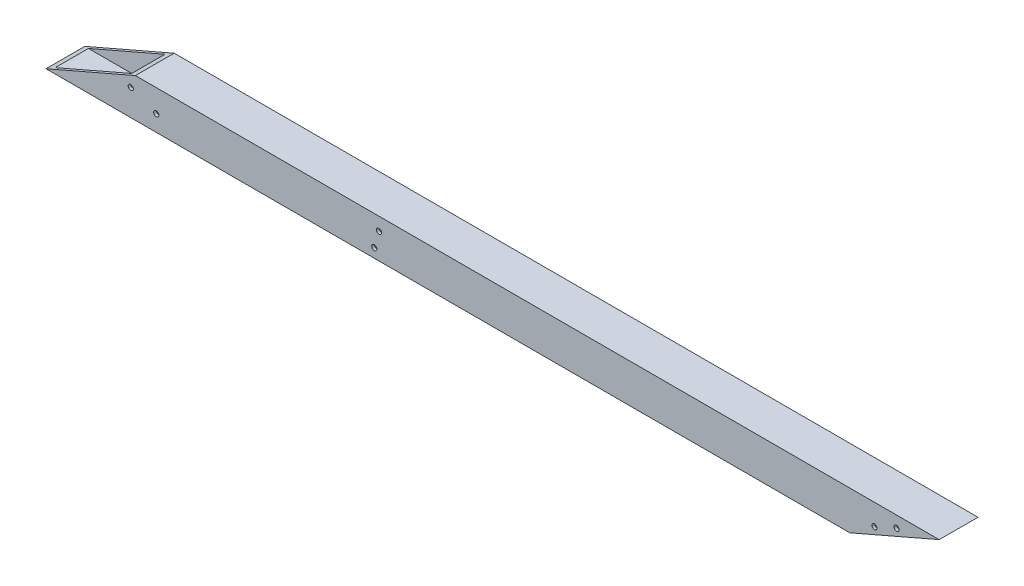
ISO-10303-21;
HEADER;
FILE_DESCRIPTION(('STEP AP214'),'2;1');
FILE_NAME('part.step','',(''),(''),'','','');
FILE_SCHEMA(('AUTOMOTIVE_DESIGN { 1 0 10303 214 1 1 1 1 }'));
ENDSEC;
DATA;
#1=APPLICATION_CONTEXT('core data for automotive mechanical design processes');
#2=APPLICATION_PROTOCOL_DEFINITION('international standard','automotive_design',2000,#1);
#3=PRODUCT_CONTEXT('',#1,'mechanical');
#4=PRODUCT('Part','Part','',(#3));
#5=PRODUCT_RELATED_PRODUCT_CATEGORY('part','',(#4));
#6=PRODUCT_DEFINITION_FORMATION('','',#4);
#7=PRODUCT_DEFINITION_CONTEXT('part definition',#1,'design');
#8=PRODUCT_DEFINITION('design','',#6,#7);
#9=PRODUCT_DEFINITION_SHAPE('','',#8);
#10=(LENGTH_UNIT() NAMED_UNIT(*) SI_UNIT(.MILLI.,.METRE.));
#11=(NAMED_UNIT(*) PLANE_ANGLE_UNIT() SI_UNIT($,.RADIAN.));
#12=(NAMED_UNIT(*) SI_UNIT($,.STERADIAN.) SOLID_ANGLE_UNIT());
#13=UNCERTAINTY_MEASURE_WITH_UNIT(LENGTH_MEASURE(1.E-05),#10,'distance_accuracy_value','');
#14=(GEOMETRIC_REPRESENTATION_CONTEXT(3) GLOBAL_UNCERTAINTY_ASSIGNED_CONTEXT((#13)) GLOBAL_UNIT_ASSIGNED_CONTEXT((#10,
#11,#12)) REPRESENTATION_CONTEXT('',''));
#15=CARTESIAN_POINT('',(0.,0.,0.));
#16=DIRECTION('',(0.,0.,1.));
#17=DIRECTION('',(1.,0.,0.));
#18=AXIS2_PLACEMENT_3D('',#15,#16,#17);
#19=CARTESIAN_POINT('',(3048.,0.,0.));
#20=DIRECTION('',(0.,0.,-1.));
#21=DIRECTION('',(-1.,0.,0.));
#22=AXIS2_PLACEMENT_3D('',#19,#20,#21);
#23=PLANE('',#22);
#24=CARTESIAN_POINT('',(1989.14315691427,34.3210482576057,0.));
#25=DIRECTION('',(0.,0.,-1.));
#26=DIRECTION('',(-1.,0.,0.));
#27=AXIS2_PLACEMENT_3D('',#24,#25,#26);
#28=CIRCLE('',#27,3.37312000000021);
#29=CARTESIAN_POINT('',(1985.77003691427,34.3210482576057,0.));
#30=VERTEX_POINT('',#29);
#31=EDGE_CURVE('E264',#30,#30,#28,.T.);
#32=ORIENTED_EDGE('',*,*,#31,.T.);
#33=EDGE_LOOP('',(#32));
#34=FACE_BOUND('',#33,.T.);
#35=CARTESIAN_POINT('',(2022.55519451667,21.1318199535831,0.));
#36=DIRECTION('',(0.,0.,-1.));
#37=DIRECTION('',(-1.,0.,0.));
#38=AXIS2_PLACEMENT_3D('',#35,#36,#37);
#39=CIRCLE('',#38,3.37312000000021);
#40=CARTESIAN_POINT('',(2019.18207451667,21.1318199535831,0.));
#41=VERTEX_POINT('',#40);
#42=EDGE_CURVE('E149',#41,#41,#39,.T.);
#43=ORIENTED_EDGE('',*,*,#42,.T.);
#44=EDGE_LOOP('',(#43));
#45=FACE_BOUND('',#44,.T.);
#46=CARTESIAN_POINT('',(2963.08326594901,23.0188741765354,0.));
#47=DIRECTION('',(0.,0.,1.));
#48=DIRECTION('',(1.,0.,0.));
#49=AXIS2_PLACEMENT_3D('',#46,#47,#48);
#50=CIRCLE('',#49,3.3731200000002);
#51=CARTESIAN_POINT('',(2966.45638594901,23.0188741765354,0.));
#52=VERTEX_POINT('',#51);
#53=EDGE_CURVE('E189',#52,#52,#50,.T.);
#54=ORIENTED_EDGE('',*,*,#53,.F.);
#55=EDGE_LOOP('',(#54));
#56=FACE_BOUND('',#55,.T.);
#57=CARTESIAN_POINT('',(2314.32734260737,33.6323173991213,0.));
#58=DIRECTION('',(0.,0.,1.));
#59=DIRECTION('',(1.,0.,0.));
#60=AXIS2_PLACEMENT_3D('',#57,#58,#59);
#61=CIRCLE('',#60,3.37312000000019);
#62=CARTESIAN_POINT('',(2317.70046260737,33.6323173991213,0.));
#63=VERTEX_POINT('',#62);
#64=EDGE_CURVE('E196',#63,#63,#61,.T.);
#65=ORIENTED_EDGE('',*,*,#64,.F.);
#66=EDGE_LOOP('',(#65));
#67=FACE_BOUND('',#66,.T.);
#68=CARTESIAN_POINT('',(2308.10725809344,12.0605349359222,0.));
#69=DIRECTION('',(0.,0.,1.));
#70=DIRECTION('',(1.,0.,0.));
#71=AXIS2_PLACEMENT_3D('',#68,#69,#70);
#72=CIRCLE('',#71,3.3731200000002);
#73=CARTESIAN_POINT('',(2311.48037809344,12.0605349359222,0.));
#74=VERTEX_POINT('',#73);
#75=EDGE_CURVE('E203',#74,#74,#72,.T.);
#76=ORIENTED_EDGE('',*,*,#75,.F.);
#77=EDGE_LOOP('',(#76));
#78=FACE_BOUND('',#77,.T.);
#79=CARTESIAN_POINT('',(2992.12254868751,35.8556400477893,0.));
#80=DIRECTION('',(0.,0.,1.));
#81=DIRECTION('',(1.,0.,0.));
#82=AXIS2_PLACEMENT_3D('',#79,#80,#81);
#83=CIRCLE('',#82,3.37312000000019);
#84=CARTESIAN_POINT('',(2995.49566868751,35.8556400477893,0.));
#85=VERTEX_POINT('',#84);
#86=EDGE_CURVE('E210',#85,#85,#83,.T.);
#87=ORIENTED_EDGE('',*,*,#86,.F.);
#88=EDGE_LOOP('',(#87));
#89=FACE_BOUND('',#88,.T.);
#90=DIRECTION('',(-1.,0.,0.));
#91=VECTOR('',#90,1.);
#92=CARTESIAN_POINT('',(3048.,0.,0.));
#93=LINE('',#92,#91);
#94=CARTESIAN_POINT('',(2930.93692171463,0.,0.));
#95=VERTEX_POINT('',#94);
#96=CARTESIAN_POINT('',(1878.151441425,0.,0.));
#97=VERTEX_POINT('',#96);
#98=EDGE_CURVE('E38',#95,#97,#93,.T.);
#99=ORIENTED_EDGE('',*,*,#98,.F.);
#100=DIRECTION('',(0.917347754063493,0.398086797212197,0.));
#101=VECTOR('',#100,1.);
#102=CARTESIAN_POINT('',(3048.,50.8,0.));
#103=LINE('',#102,#101);
#104=CARTESIAN_POINT('',(3048.,50.8,0.));
#105=VERTEX_POINT('',#104);
#106=EDGE_CURVE('E99',#95,#105,#103,.T.);
#107=ORIENTED_EDGE('',*,*,#106,.T.);
#108=DIRECTION('',(-1.,0.,0.));
#109=VECTOR('',#108,1.);
#110=CARTESIAN_POINT('',(3048.,50.8,0.));
#111=LINE('',#110,#109);
#112=CARTESIAN_POINT('',(1995.21451971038,50.8,0.));
#113=VERTEX_POINT('',#112);
#114=EDGE_CURVE('E107',#105,#113,#111,.T.);
#115=ORIENTED_EDGE('',*,*,#114,.T.);
#116=DIRECTION('',(-0.917347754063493,-0.398086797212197,0.));
#117=VECTOR('',#116,1.);
#118=CARTESIAN_POINT('',(1878.151441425,0.,0.));
#119=LINE('',#118,#117);
#120=EDGE_CURVE('E173',#113,#97,#119,.T.);
#121=ORIENTED_EDGE('',*,*,#120,.T.);
#122=EDGE_LOOP('',(#99,#107,#115,#121));
#123=FACE_BOUND('',#122,.T.);
#124=ADVANCED_FACE('F30',(#34,#45,#56,#67,#78,#89,#123),#23,.F.);
#125=CARTESIAN_POINT('',(3048.,0.,0.));
#126=DIRECTION('',(0.,1.,0.));
#127=DIRECTION('',(0.,0.,1.));
#128=AXIS2_PLACEMENT_3D('',#125,#126,#127);
#129=PLANE('',#128);
#130=DIRECTION('',(-1.,0.,0.));
#131=VECTOR('',#130,1.);
#132=CARTESIAN_POINT('',(3048.,0.,-50.8));
#133=LINE('',#132,#131);
#134=CARTESIAN_POINT('',(2930.93692171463,0.,-50.8));
#135=VERTEX_POINT('',#134);
#136=CARTESIAN_POINT('',(1878.151441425,0.,-50.8));
#137=VERTEX_POINT('',#136);
#138=EDGE_CURVE('E121',#135,#137,#133,.T.);
#139=ORIENTED_EDGE('',*,*,#138,.F.);
#140=DIRECTION('',(0.,0.,1.));
#141=VECTOR('',#140,1.);
#142=CARTESIAN_POINT('',(2930.93692171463,0.,0.));
#143=LINE('',#142,#141);
#144=EDGE_CURVE('E170',#135,#95,#143,.T.);
#145=ORIENTED_EDGE('',*,*,#144,.T.);
#146=ORIENTED_EDGE('',*,*,#98,.T.);
#147=DIRECTION('',(0.,0.,-1.));
#148=VECTOR('',#147,1.);
#149=CARTESIAN_POINT('',(1878.151441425,0.,0.));
#150=LINE('',#149,#148);
#151=EDGE_CURVE('E217',#97,#137,#150,.T.);
#152=ORIENTED_EDGE('',*,*,#151,.T.);
#153=EDGE_LOOP('',(#139,#145,#146,#152));
#154=FACE_BOUND('',#153,.T.);
#155=ADVANCED_FACE('F255',(#154),#129,.F.);
#156=CARTESIAN_POINT('',(3048.,0.,-50.8));
#157=DIRECTION('',(0.,0.,1.));
#158=DIRECTION('',(1.,0.,0.));
#159=AXIS2_PLACEMENT_3D('',#156,#157,#158);
#160=PLANE('',#159);
#161=CARTESIAN_POINT('',(1989.14315691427,34.3210482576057,-50.8));
#162=DIRECTION('',(0.,0.,-1.));
#163=DIRECTION('',(-1.,0.,0.));
#164=AXIS2_PLACEMENT_3D('',#161,#162,#163);
#165=CIRCLE('',#164,3.37312000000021);
#166=CARTESIAN_POINT('',(1985.77003691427,34.3210482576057,-50.8));
#167=VERTEX_POINT('',#166);
#168=EDGE_CURVE('E309',#167,#167,#165,.T.);
#169=ORIENTED_EDGE('',*,*,#168,.F.);
#170=EDGE_LOOP('',(#169));
#171=FACE_BOUND('',#170,.T.);
#172=CARTESIAN_POINT('',(2022.55519451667,21.1318199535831,-50.8));
#173=DIRECTION('',(0.,0.,-1.));
#174=DIRECTION('',(-1.,0.,0.));
#175=AXIS2_PLACEMENT_3D('',#172,#173,#174);
#176=CIRCLE('',#175,3.37312000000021);
#177=CARTESIAN_POINT('',(2019.18207451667,21.1318199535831,-50.8));
#178=VERTEX_POINT('',#177);
#179=EDGE_CURVE('E155',#178,#178,#176,.T.);
#180=ORIENTED_EDGE('',*,*,#179,.F.);
#181=EDGE_LOOP('',(#180));
#182=FACE_BOUND('',#181,.T.);
#183=CARTESIAN_POINT('',(2963.08326594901,23.0188741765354,-50.8));
#184=DIRECTION('',(0.,0.,1.));
#185=DIRECTION('',(1.,0.,0.));
#186=AXIS2_PLACEMENT_3D('',#183,#184,#185);
#187=CIRCLE('',#186,3.3731200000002);
#188=CARTESIAN_POINT('',(2966.45638594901,23.0188741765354,-50.8));
#189=VERTEX_POINT('',#188);
#190=EDGE_CURVE('E145',#189,#189,#187,.T.);
#191=ORIENTED_EDGE('',*,*,#190,.T.);
#192=EDGE_LOOP('',(#191));
#193=FACE_BOUND('',#192,.T.);
#194=CARTESIAN_POINT('',(2314.32734260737,33.6323173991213,-50.8));
#195=DIRECTION('',(0.,0.,1.));
#196=DIRECTION('',(1.,0.,0.));
#197=AXIS2_PLACEMENT_3D('',#194,#195,#196);
#198=CIRCLE('',#197,3.37312000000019);
#199=CARTESIAN_POINT('',(2317.70046260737,33.6323173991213,-50.8));
#200=VERTEX_POINT('',#199);
#201=EDGE_CURVE('E141',#200,#200,#198,.T.);
#202=ORIENTED_EDGE('',*,*,#201,.T.);
#203=EDGE_LOOP('',(#202));
#204=FACE_BOUND('',#203,.T.);
#205=CARTESIAN_POINT('',(2308.10725809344,12.0605349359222,-50.8));
#206=DIRECTION('',(0.,0.,1.));
#207=DIRECTION('',(1.,0.,0.));
#208=AXIS2_PLACEMENT_3D('',#205,#206,#207);
#209=CIRCLE('',#208,3.3731200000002);
#210=CARTESIAN_POINT('',(2311.48037809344,12.0605349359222,-50.8));
#211=VERTEX_POINT('',#210);
#212=EDGE_CURVE('E136',#211,#211,#209,.T.);
#213=ORIENTED_EDGE('',*,*,#212,.T.);
#214=EDGE_LOOP('',(#213));
#215=FACE_BOUND('',#214,.T.);
#216=CARTESIAN_POINT('',(2992.12254868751,35.8556400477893,-50.8));
#217=DIRECTION('',(0.,0.,1.));
#218=DIRECTION('',(1.,0.,0.));
#219=AXIS2_PLACEMENT_3D('',#216,#217,#218);
#220=CIRCLE('',#219,3.37312000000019);
#221=CARTESIAN_POINT('',(2995.49566868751,35.8556400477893,-50.8));
#222=VERTEX_POINT('',#221);
#223=EDGE_CURVE('E131',#222,#222,#220,.T.);
#224=ORIENTED_EDGE('',*,*,#223,.T.);
#225=EDGE_LOOP('',(#224));
#226=FACE_BOUND('',#225,.T.);
#227=DIRECTION('',(-1.,0.,0.));
#228=VECTOR('',#227,1.);
#229=CARTESIAN_POINT('',(3048.,50.8,-50.8));
#230=LINE('',#229,#228);
#231=CARTESIAN_POINT('',(3048.,50.8,-50.8));
#232=VERTEX_POINT('',#231);
#233=CARTESIAN_POINT('',(1995.21451971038,50.8,-50.8));
#234=VERTEX_POINT('',#233);
#235=EDGE_CURVE('E119',#232,#234,#230,.T.);
#236=ORIENTED_EDGE('',*,*,#235,.F.);
#237=DIRECTION('',(0.917347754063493,0.398086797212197,0.));
#238=VECTOR('',#237,1.);
#239=CARTESIAN_POINT('',(3048.,50.8,-50.8));
#240=LINE('',#239,#238);
#241=EDGE_CURVE('E102',#135,#232,#240,.T.);
#242=ORIENTED_EDGE('',*,*,#241,.F.);
#243=ORIENTED_EDGE('',*,*,#138,.T.);
#244=DIRECTION('',(-0.917347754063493,-0.398086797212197,0.));
#245=VECTOR('',#244,1.);
#246=CARTESIAN_POINT('',(1878.151441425,0.,-50.8));
#247=LINE('',#246,#245);
#248=EDGE_CURVE('E172',#234,#137,#247,.T.);
#249=ORIENTED_EDGE('',*,*,#248,.F.);
#250=EDGE_LOOP('',(#236,#242,#243,#249));
#251=FACE_BOUND('',#250,.T.);
#252=ADVANCED_FACE('F260',(#171,#182,#193,#204,#215,#226,#251),#160,.F.);
#253=CARTESIAN_POINT('',(3048.,50.8,0.));
#254=DIRECTION('',(0.,-1.,0.));
#255=DIRECTION('',(0.,0.,-1.));
#256=AXIS2_PLACEMENT_3D('',#253,#254,#255);
#257=PLANE('',#256);
#258=ORIENTED_EDGE('',*,*,#235,.T.);
#259=DIRECTION('',(0.,0.,1.));
#260=VECTOR('',#259,1.);
#261=CARTESIAN_POINT('',(1995.21451971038,50.8,0.));
#262=LINE('',#261,#260);
#263=EDGE_CURVE('E118',#234,#113,#262,.T.);
#264=ORIENTED_EDGE('',*,*,#263,.T.);
#265=ORIENTED_EDGE('',*,*,#114,.F.);
#266=DIRECTION('',(0.,0.,1.));
#267=VECTOR('',#266,1.);
#268=CARTESIAN_POINT('',(3048.,50.8,0.));
#269=LINE('',#268,#267);
#270=EDGE_CURVE('E96',#232,#105,#269,.T.);
#271=ORIENTED_EDGE('',*,*,#270,.F.);
#272=EDGE_LOOP('',(#258,#264,#265,#271));
#273=FACE_BOUND('',#272,.T.);
#274=ADVANCED_FACE('F117',(#273),#257,.F.);
#275=CARTESIAN_POINT('',(3048.,47.1424,-3.6576));
#276=DIRECTION('',(0.,0.,-1.));
#277=DIRECTION('',(0.,1.,0.));
#278=AXIS2_PLACEMENT_3D('',#275,#276,#277);
#279=PLANE('',#278);
#280=CARTESIAN_POINT('',(1989.14315691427,34.3210482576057,-3.6576));
#281=DIRECTION('',(0.,0.,-1.));
#282=DIRECTION('',(0.,1.,0.));
#283=AXIS2_PLACEMENT_3D('',#280,#281,#282);
#284=CIRCLE('',#283,3.37312000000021);
#285=CARTESIAN_POINT('',(1989.14315691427,37.6941682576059,-3.6576));
#286=VERTEX_POINT('',#285);
#287=EDGE_CURVE('E160',#286,#286,#284,.T.);
#288=ORIENTED_EDGE('',*,*,#287,.F.);
#289=EDGE_LOOP('',(#288));
#290=FACE_BOUND('',#289,.T.);
#291=CARTESIAN_POINT('',(2022.55519451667,21.1318199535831,-3.6576));
#292=DIRECTION('',(0.,0.,-1.));
#293=DIRECTION('',(0.,1.,0.));
#294=AXIS2_PLACEMENT_3D('',#291,#292,#293);
#295=CIRCLE('',#294,3.37312000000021);
#296=CARTESIAN_POINT('',(2022.55519451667,24.5049399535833,-3.6576));
#297=VERTEX_POINT('',#296);
#298=EDGE_CURVE('E148',#297,#297,#295,.T.);
#299=ORIENTED_EDGE('',*,*,#298,.F.);
#300=EDGE_LOOP('',(#299));
#301=FACE_BOUND('',#300,.T.);
#302=DIRECTION('',(0.917347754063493,0.398086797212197,0.));
#303=VECTOR('',#302,1.);
#304=CARTESIAN_POINT('',(3046.66430289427,50.2203687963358,-3.6576));
#305=LINE('',#304,#303);
#306=CARTESIAN_POINT('',(2939.36546335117,3.6576,-3.6576));
#307=VERTEX_POINT('',#306);
#308=CARTESIAN_POINT('',(3039.57145836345,47.1424,-3.6576));
#309=VERTEX_POINT('',#308);
#310=EDGE_CURVE('E45',#307,#309,#305,.T.);
#311=ORIENTED_EDGE('',*,*,#310,.F.);
#312=DIRECTION('',(-1.,0.,0.));
#313=VECTOR('',#312,1.);
#314=CARTESIAN_POINT('',(3048.,3.6576,-3.6576));
#315=LINE('',#314,#313);
#316=CARTESIAN_POINT('',(1886.57998306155,3.6576,-3.6576));
#317=VERTEX_POINT('',#316);
#318=EDGE_CURVE('E108',#307,#317,#315,.T.);
#319=ORIENTED_EDGE('',*,*,#318,.T.);
#320=DIRECTION('',(-0.917347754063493,-0.398086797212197,0.));
#321=VECTOR('',#320,1.);
#322=CARTESIAN_POINT('',(2879.82612618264,434.680812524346,-3.65759999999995));
#323=LINE('',#322,#321);
#324=CARTESIAN_POINT('',(1986.78597807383,47.1424,-3.6576));
#325=VERTEX_POINT('',#324);
#326=EDGE_CURVE('E185',#325,#317,#323,.T.);
#327=ORIENTED_EDGE('',*,*,#326,.F.);
#328=DIRECTION('',(-1.,0.,0.));
#329=VECTOR('',#328,1.);
#330=CARTESIAN_POINT('',(3048.,47.1424,-3.6576));
#331=LINE('',#330,#329);
#332=EDGE_CURVE('E220',#309,#325,#331,.T.);
#333=ORIENTED_EDGE('',*,*,#332,.F.);
#334=EDGE_LOOP('',(#311,#319,#327,#333));
#335=FACE_BOUND('',#334,.T.);
#336=CARTESIAN_POINT('',(2963.08326594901,23.0188741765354,-3.6576));
#337=DIRECTION('',(0.,0.,-1.));
#338=DIRECTION('',(0.,1.,0.));
#339=AXIS2_PLACEMENT_3D('',#336,#337,#338);
#340=CIRCLE('',#339,3.3731200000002);
#341=CARTESIAN_POINT('',(2963.08326594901,26.3919941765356,-3.6576));
#342=VERTEX_POINT('',#341);
#343=EDGE_CURVE('E144',#342,#342,#340,.T.);
#344=ORIENTED_EDGE('',*,*,#343,.F.);
#345=EDGE_LOOP('',(#344));
#346=FACE_BOUND('',#345,.T.);
#347=CARTESIAN_POINT('',(2314.32734260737,33.6323173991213,-3.6576));
#348=DIRECTION('',(0.,0.,-1.));
#349=DIRECTION('',(0.,1.,0.));
#350=AXIS2_PLACEMENT_3D('',#347,#348,#349);
#351=CIRCLE('',#350,3.37312000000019);
#352=CARTESIAN_POINT('',(2314.32734260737,37.0054373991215,-3.6576));
#353=VERTEX_POINT('',#352);
#354=EDGE_CURVE('E140',#353,#353,#351,.T.);
#355=ORIENTED_EDGE('',*,*,#354,.F.);
#356=EDGE_LOOP('',(#355));
#357=FACE_BOUND('',#356,.T.);
#358=CARTESIAN_POINT('',(2308.10725809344,12.0605349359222,-3.6576));
#359=DIRECTION('',(0.,0.,-1.));
#360=DIRECTION('',(0.,1.,0.));
#361=AXIS2_PLACEMENT_3D('',#358,#359,#360);
#362=CIRCLE('',#361,3.3731200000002);
#363=CARTESIAN_POINT('',(2308.10725809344,15.4336549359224,-3.6576));
#364=VERTEX_POINT('',#363);
#365=EDGE_CURVE('E135',#364,#364,#362,.T.);
#366=ORIENTED_EDGE('',*,*,#365,.F.);
#367=EDGE_LOOP('',(#366));
#368=FACE_BOUND('',#367,.T.);
#369=CARTESIAN_POINT('',(2992.12254868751,35.8556400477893,-3.6576));
#370=DIRECTION('',(0.,0.,-1.));
#371=DIRECTION('',(0.,1.,0.));
#372=AXIS2_PLACEMENT_3D('',#369,#370,#371);
#373=CIRCLE('',#372,3.37312000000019);
#374=CARTESIAN_POINT('',(2992.12254868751,39.2287600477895,-3.6576));
#375=VERTEX_POINT('',#374);
#376=EDGE_CURVE('E130',#375,#375,#373,.T.);
#377=ORIENTED_EDGE('',*,*,#376,.F.);
#378=EDGE_LOOP('',(#377));
#379=FACE_BOUND('',#378,.T.);
#380=ADVANCED_FACE('F227',(#290,#301,#335,#346,#357,#368,#379),#279,.T.);
#381=CARTESIAN_POINT('',(3048.,3.6576,-3.6576));
#382=DIRECTION('',(0.,1.,0.));
#383=DIRECTION('',(0.,0.,1.));
#384=AXIS2_PLACEMENT_3D('',#381,#382,#383);
#385=PLANE('',#384);
#386=DIRECTION('',(0.,0.,1.));
#387=VECTOR('',#386,1.);
#388=CARTESIAN_POINT('',(2939.36546335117,3.6576,-3.6576));
#389=LINE('',#388,#387);
#390=CARTESIAN_POINT('',(2939.36546335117,3.6576,-47.1424));
#391=VERTEX_POINT('',#390);
#392=EDGE_CURVE('E167',#391,#307,#389,.T.);
#393=ORIENTED_EDGE('',*,*,#392,.F.);
#394=DIRECTION('',(-1.,0.,0.));
#395=VECTOR('',#394,1.);
#396=CARTESIAN_POINT('',(3048.,3.6576,-47.1424));
#397=LINE('',#396,#395);
#398=CARTESIAN_POINT('',(1886.57998306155,3.65760000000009,-47.1424));
#399=VERTEX_POINT('',#398);
#400=EDGE_CURVE('E223',#391,#399,#397,.T.);
#401=ORIENTED_EDGE('',*,*,#400,.T.);
#402=DIRECTION('',(0.,0.,-1.));
#403=VECTOR('',#402,1.);
#404=CARTESIAN_POINT('',(1886.57998306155,3.6576,-3.6576));
#405=LINE('',#404,#403);
#406=EDGE_CURVE('E182',#317,#399,#405,.T.);
#407=ORIENTED_EDGE('',*,*,#406,.F.);
#408=ORIENTED_EDGE('',*,*,#318,.F.);
#409=EDGE_LOOP('',(#393,#401,#407,#408));
#410=FACE_BOUND('',#409,.T.);
#411=ADVANCED_FACE('F237',(#410),#385,.T.);
#412=CARTESIAN_POINT('',(3048.,47.1424,-47.1424));
#413=DIRECTION('',(0.,0.,1.));
#414=DIRECTION('',(0.,-1.,0.));
#415=AXIS2_PLACEMENT_3D('',#412,#413,#414);
#416=PLANE('',#415);
#417=CARTESIAN_POINT('',(1989.14315691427,34.3210482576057,-47.1424));
#418=DIRECTION('',(0.,0.,1.));
#419=DIRECTION('',(0.,-1.,0.));
#420=AXIS2_PLACEMENT_3D('',#417,#418,#419);
#421=CIRCLE('',#420,3.37312000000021);
#422=CARTESIAN_POINT('',(1989.14315691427,30.9479282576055,-47.1424));
#423=VERTEX_POINT('',#422);
#424=EDGE_CURVE('E33',#423,#423,#421,.T.);
#425=ORIENTED_EDGE('',*,*,#424,.F.);
#426=EDGE_LOOP('',(#425));
#427=FACE_BOUND('',#426,.T.);
#428=CARTESIAN_POINT('',(2022.55519451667,21.1318199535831,-47.1424));
#429=DIRECTION('',(0.,0.,1.));
#430=DIRECTION('',(0.,-1.,0.));
#431=AXIS2_PLACEMENT_3D('',#428,#429,#430);
#432=CIRCLE('',#431,3.37312000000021);
#433=CARTESIAN_POINT('',(2022.55519451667,17.7586999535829,-47.1424));
#434=VERTEX_POINT('',#433);
#435=EDGE_CURVE('E146',#434,#434,#432,.T.);
#436=ORIENTED_EDGE('',*,*,#435,.F.);
#437=EDGE_LOOP('',(#436));
#438=FACE_BOUND('',#437,.T.);
#439=DIRECTION('',(-0.917347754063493,-0.398086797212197,0.));
#440=VECTOR('',#439,1.);
#441=CARTESIAN_POINT('',(3046.66430289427,50.2203687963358,-47.1424));
#442=LINE('',#441,#440);
#443=CARTESIAN_POINT('',(3039.57145836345,47.1424,-47.1424));
#444=VERTEX_POINT('',#443);
#445=EDGE_CURVE('E114',#444,#391,#442,.T.);
#446=ORIENTED_EDGE('',*,*,#445,.F.);
#447=DIRECTION('',(-1.,0.,0.));
#448=VECTOR('',#447,1.);
#449=CARTESIAN_POINT('',(3048.,47.1424,-47.1424));
#450=LINE('',#449,#448);
#451=CARTESIAN_POINT('',(1986.78597807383,47.1424,-47.1424));
#452=VERTEX_POINT('',#451);
#453=EDGE_CURVE('E53',#444,#452,#450,.T.);
#454=ORIENTED_EDGE('',*,*,#453,.T.);
#455=DIRECTION('',(0.917347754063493,0.398086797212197,0.));
#456=VECTOR('',#455,1.);
#457=CARTESIAN_POINT('',(2879.82612618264,434.680812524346,-47.1423999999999));
#458=LINE('',#457,#456);
#459=EDGE_CURVE('E180',#399,#452,#458,.T.);
#460=ORIENTED_EDGE('',*,*,#459,.F.);
#461=ORIENTED_EDGE('',*,*,#400,.F.);
#462=EDGE_LOOP('',(#446,#454,#460,#461));
#463=FACE_BOUND('',#462,.T.);
#464=CARTESIAN_POINT('',(2963.08326594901,23.0188741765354,-47.1424));
#465=DIRECTION('',(0.,0.,1.));
#466=DIRECTION('',(0.,-1.,0.));
#467=AXIS2_PLACEMENT_3D('',#464,#465,#466);
#468=CIRCLE('',#467,3.3731200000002);
#469=CARTESIAN_POINT('',(2963.08326594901,19.6457541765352,-47.1424));
#470=VERTEX_POINT('',#469);
#471=EDGE_CURVE('E142',#470,#470,#468,.T.);
#472=ORIENTED_EDGE('',*,*,#471,.F.);
#473=EDGE_LOOP('',(#472));
#474=FACE_BOUND('',#473,.T.);
#475=CARTESIAN_POINT('',(2314.32734260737,33.6323173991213,-47.1424));
#476=DIRECTION('',(0.,0.,1.));
#477=DIRECTION('',(0.,-1.,0.));
#478=AXIS2_PLACEMENT_3D('',#475,#476,#477);
#479=CIRCLE('',#478,3.37312000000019);
#480=CARTESIAN_POINT('',(2314.32734260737,30.2591973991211,-47.1424));
#481=VERTEX_POINT('',#480);
#482=EDGE_CURVE('E137',#481,#481,#479,.T.);
#483=ORIENTED_EDGE('',*,*,#482,.F.);
#484=EDGE_LOOP('',(#483));
#485=FACE_BOUND('',#484,.T.);
#486=CARTESIAN_POINT('',(2308.10725809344,12.0605349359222,-47.1424));
#487=DIRECTION('',(0.,0.,1.));
#488=DIRECTION('',(0.,-1.,0.));
#489=AXIS2_PLACEMENT_3D('',#486,#487,#488);
#490=CIRCLE('',#489,3.3731200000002);
#491=CARTESIAN_POINT('',(2308.10725809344,8.68741493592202,-47.1424));
#492=VERTEX_POINT('',#491);
#493=EDGE_CURVE('E132',#492,#492,#490,.T.);
#494=ORIENTED_EDGE('',*,*,#493,.F.);
#495=EDGE_LOOP('',(#494));
#496=FACE_BOUND('',#495,.T.);
#497=CARTESIAN_POINT('',(2992.12254868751,35.8556400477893,-47.1424));
#498=DIRECTION('',(0.,0.,1.));
#499=DIRECTION('',(0.,-1.,0.));
#500=AXIS2_PLACEMENT_3D('',#497,#498,#499);
#501=CIRCLE('',#500,3.37312000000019);
#502=CARTESIAN_POINT('',(2992.12254868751,32.4825200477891,-47.1424));
#503=VERTEX_POINT('',#502);
#504=EDGE_CURVE('E127',#503,#503,#501,.T.);
#505=ORIENTED_EDGE('',*,*,#504,.F.);
#506=EDGE_LOOP('',(#505));
#507=FACE_BOUND('',#506,.T.);
#508=ADVANCED_FACE('F239',(#427,#438,#463,#474,#485,#496,#507),#416,.T.);
#509=CARTESIAN_POINT('',(3048.,47.1424,-3.6576));
#510=DIRECTION('',(0.,-1.,0.));
#511=DIRECTION('',(0.,0.,-1.));
#512=AXIS2_PLACEMENT_3D('',#509,#510,#511);
#513=PLANE('',#512);
#514=DIRECTION('',(0.,0.,-1.));
#515=VECTOR('',#514,1.);
#516=CARTESIAN_POINT('',(3039.57145836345,47.1424,-3.6576));
#517=LINE('',#516,#515);
#518=EDGE_CURVE('E11',#309,#444,#517,.T.);
#519=ORIENTED_EDGE('',*,*,#518,.F.);
#520=ORIENTED_EDGE('',*,*,#332,.T.);
#521=DIRECTION('',(0.,0.,1.));
#522=VECTOR('',#521,1.);
#523=CARTESIAN_POINT('',(1986.78597807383,47.1424,-3.6576));
#524=LINE('',#523,#522);
#525=EDGE_CURVE('E175',#452,#325,#524,.T.);
#526=ORIENTED_EDGE('',*,*,#525,.F.);
#527=ORIENTED_EDGE('',*,*,#453,.F.);
#528=EDGE_LOOP('',(#519,#520,#526,#527));
#529=FACE_BOUND('',#528,.T.);
#530=ADVANCED_FACE('F242',(#529),#513,.T.);
#531=CARTESIAN_POINT('',(2992.12254868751,35.8556400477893,-50.8));
#532=DIRECTION('',(0.,0.,1.));
#533=DIRECTION('',(1.,0.,0.));
#534=AXIS2_PLACEMENT_3D('',#531,#532,#533);
#535=CYLINDRICAL_SURFACE('',#534,3.37312000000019);
#536=ORIENTED_EDGE('',*,*,#504,.T.);
#537=EDGE_LOOP('',(#536));
#538=FACE_BOUND('',#537,.T.);
#539=ORIENTED_EDGE('',*,*,#223,.F.);
#540=EDGE_LOOP('',(#539));
#541=FACE_BOUND('',#540,.T.);
#542=ADVANCED_FACE('F277',(#538,#541),#535,.F.);
#543=ORIENTED_EDGE('',*,*,#376,.T.);
#544=EDGE_LOOP('',(#543));
#545=FACE_BOUND('',#544,.T.);
#546=ORIENTED_EDGE('',*,*,#86,.T.);
#547=EDGE_LOOP('',(#546));
#548=FACE_BOUND('',#547,.T.);
#549=ADVANCED_FACE('F274',(#545,#548),#535,.F.);
#550=CARTESIAN_POINT('',(2308.10725809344,12.0605349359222,-50.8));
#551=DIRECTION('',(0.,0.,1.));
#552=DIRECTION('',(1.,0.,0.));
#553=AXIS2_PLACEMENT_3D('',#550,#551,#552);
#554=CYLINDRICAL_SURFACE('',#553,3.3731200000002);
#555=ORIENTED_EDGE('',*,*,#493,.T.);
#556=EDGE_LOOP('',(#555));
#557=FACE_BOUND('',#556,.T.);
#558=ORIENTED_EDGE('',*,*,#212,.F.);
#559=EDGE_LOOP('',(#558));
#560=FACE_BOUND('',#559,.T.);
#561=ADVANCED_FACE('F276',(#557,#560),#554,.F.);
#562=ORIENTED_EDGE('',*,*,#365,.T.);
#563=EDGE_LOOP('',(#562));
#564=FACE_BOUND('',#563,.T.);
#565=ORIENTED_EDGE('',*,*,#75,.T.);
#566=EDGE_LOOP('',(#565));
#567=FACE_BOUND('',#566,.T.);
#568=ADVANCED_FACE('F284',(#564,#567),#554,.F.);
#569=CARTESIAN_POINT('',(2314.32734260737,33.6323173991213,-50.8));
#570=DIRECTION('',(0.,0.,1.));
#571=DIRECTION('',(1.,0.,0.));
#572=AXIS2_PLACEMENT_3D('',#569,#570,#571);
#573=CYLINDRICAL_SURFACE('',#572,3.37312000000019);
#574=ORIENTED_EDGE('',*,*,#482,.T.);
#575=EDGE_LOOP('',(#574));
#576=FACE_BOUND('',#575,.T.);
#577=ORIENTED_EDGE('',*,*,#201,.F.);
#578=EDGE_LOOP('',(#577));
#579=FACE_BOUND('',#578,.T.);
#580=ADVANCED_FACE('F326',(#576,#579),#573,.F.);
#581=ORIENTED_EDGE('',*,*,#354,.T.);
#582=EDGE_LOOP('',(#581));
#583=FACE_BOUND('',#582,.T.);
#584=ORIENTED_EDGE('',*,*,#64,.T.);
#585=EDGE_LOOP('',(#584));
#586=FACE_BOUND('',#585,.T.);
#587=ADVANCED_FACE('F328',(#583,#586),#573,.F.);
#588=CARTESIAN_POINT('',(2963.08326594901,23.0188741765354,-50.8));
#589=DIRECTION('',(0.,0.,1.));
#590=DIRECTION('',(1.,0.,0.));
#591=AXIS2_PLACEMENT_3D('',#588,#589,#590);
#592=CYLINDRICAL_SURFACE('',#591,3.3731200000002);
#593=ORIENTED_EDGE('',*,*,#471,.T.);
#594=EDGE_LOOP('',(#593));
#595=FACE_BOUND('',#594,.T.);
#596=ORIENTED_EDGE('',*,*,#190,.F.);
#597=EDGE_LOOP('',(#596));
#598=FACE_BOUND('',#597,.T.);
#599=ADVANCED_FACE('F334',(#595,#598),#592,.F.);
#600=ORIENTED_EDGE('',*,*,#343,.T.);
#601=EDGE_LOOP('',(#600));
#602=FACE_BOUND('',#601,.T.);
#603=ORIENTED_EDGE('',*,*,#53,.T.);
#604=EDGE_LOOP('',(#603));
#605=FACE_BOUND('',#604,.T.);
#606=ADVANCED_FACE('F252',(#602,#605),#592,.F.);
#607=CARTESIAN_POINT('',(1878.151441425,0.,0.));
#608=DIRECTION('',(0.398086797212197,-0.917347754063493,0.));
#609=DIRECTION('',(0.917347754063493,0.398086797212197,0.));
#610=AXIS2_PLACEMENT_3D('',#607,#608,#609);
#611=PLANE('',#610);
#612=ORIENTED_EDGE('',*,*,#326,.T.);
#613=ORIENTED_EDGE('',*,*,#406,.T.);
#614=ORIENTED_EDGE('',*,*,#459,.T.);
#615=ORIENTED_EDGE('',*,*,#525,.T.);
#616=EDGE_LOOP('',(#612,#613,#614,#615));
#617=FACE_BOUND('',#616,.T.);
#618=ORIENTED_EDGE('',*,*,#248,.T.);
#619=ORIENTED_EDGE('',*,*,#151,.F.);
#620=ORIENTED_EDGE('',*,*,#120,.F.);
#621=ORIENTED_EDGE('',*,*,#263,.F.);
#622=EDGE_LOOP('',(#618,#619,#620,#621));
#623=FACE_BOUND('',#622,.T.);
#624=ADVANCED_FACE('F234',(#617,#623),#611,.F.);
#625=CARTESIAN_POINT('',(3048.,50.8,0.));
#626=DIRECTION('',(-0.398086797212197,0.917347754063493,0.));
#627=DIRECTION('',(-0.917347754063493,-0.398086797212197,0.));
#628=AXIS2_PLACEMENT_3D('',#625,#626,#627);
#629=PLANE('',#628);
#630=ORIENTED_EDGE('',*,*,#310,.T.);
#631=ORIENTED_EDGE('',*,*,#518,.T.);
#632=ORIENTED_EDGE('',*,*,#445,.T.);
#633=ORIENTED_EDGE('',*,*,#392,.T.);
#634=EDGE_LOOP('',(#630,#631,#632,#633));
#635=FACE_BOUND('',#634,.T.);
#636=ORIENTED_EDGE('',*,*,#241,.T.);
#637=ORIENTED_EDGE('',*,*,#270,.T.);
#638=ORIENTED_EDGE('',*,*,#106,.F.);
#639=ORIENTED_EDGE('',*,*,#144,.F.);
#640=EDGE_LOOP('',(#636,#637,#638,#639));
#641=FACE_BOUND('',#640,.T.);
#642=ADVANCED_FACE('F98',(#635,#641),#629,.F.);
#643=CARTESIAN_POINT('',(2022.55519451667,21.1318199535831,0.));
#644=DIRECTION('',(0.,0.,-1.));
#645=DIRECTION('',(-1.,0.,0.));
#646=AXIS2_PLACEMENT_3D('',#643,#644,#645);
#647=CYLINDRICAL_SURFACE('',#646,3.37312000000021);
#648=ORIENTED_EDGE('',*,*,#435,.T.);
#649=EDGE_LOOP('',(#648));
#650=FACE_BOUND('',#649,.T.);
#651=ORIENTED_EDGE('',*,*,#179,.T.);
#652=EDGE_LOOP('',(#651));
#653=FACE_BOUND('',#652,.T.);
#654=ADVANCED_FACE('F244',(#650,#653),#647,.F.);
#655=ORIENTED_EDGE('',*,*,#298,.T.);
#656=EDGE_LOOP('',(#655));
#657=FACE_BOUND('',#656,.T.);
#658=ORIENTED_EDGE('',*,*,#42,.F.);
#659=EDGE_LOOP('',(#658));
#660=FACE_BOUND('',#659,.T.);
#661=ADVANCED_FACE('F250',(#657,#660),#647,.F.);
#662=CARTESIAN_POINT('',(1989.14315691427,34.3210482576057,0.));
#663=DIRECTION('',(0.,0.,-1.));
#664=DIRECTION('',(-1.,0.,0.));
#665=AXIS2_PLACEMENT_3D('',#662,#663,#664);
#666=CYLINDRICAL_SURFACE('',#665,3.37312000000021);
#667=ORIENTED_EDGE('',*,*,#424,.T.);
#668=EDGE_LOOP('',(#667));
#669=FACE_BOUND('',#668,.T.);
#670=ORIENTED_EDGE('',*,*,#168,.T.);
#671=EDGE_LOOP('',(#670));
#672=FACE_BOUND('',#671,.T.);
#673=ADVANCED_FACE('F415',(#669,#672),#666,.F.);
#674=ORIENTED_EDGE('',*,*,#287,.T.);
#675=EDGE_LOOP('',(#674));
#676=FACE_BOUND('',#675,.T.);
#677=ORIENTED_EDGE('',*,*,#31,.F.);
#678=EDGE_LOOP('',(#677));
#679=FACE_BOUND('',#678,.T.);
#680=ADVANCED_FACE('F424',(#676,#679),#666,.F.);
#681=CLOSED_SHELL('',(#124,#155,#252,#274,#380,#411,#508,#530,#542,#549,#561,#568,#580,#587,
#599,#606,#624,#642,#654,#661,#673,#680));
#682=MANIFOLD_SOLID_BREP('B2',#681);
#683=ADVANCED_BREP_SHAPE_REPRESENTATION('',(#18,#682),#14);
#684=SHAPE_DEFINITION_REPRESENTATION(#9,#683);
ENDSEC;
END-ISO-10303-21;
